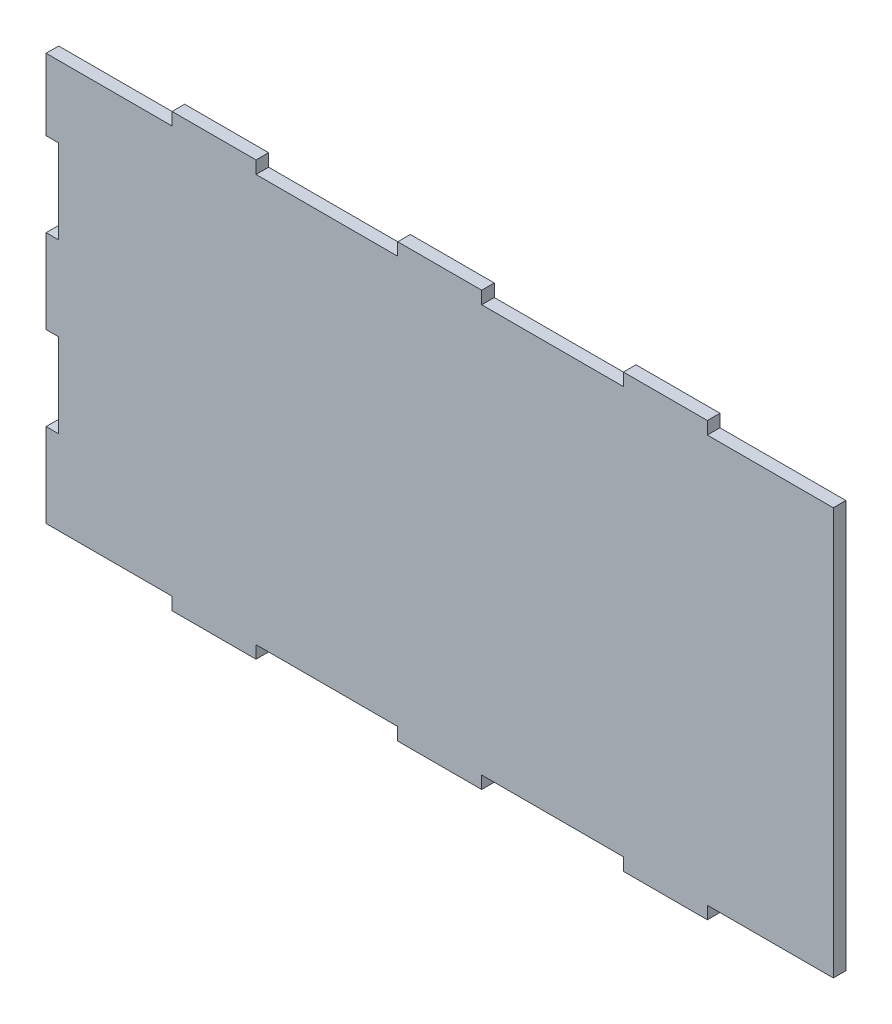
ISO-10303-21;
HEADER;
FILE_DESCRIPTION(('STEP AP214'),'2;1');
FILE_NAME('part.step','',(''),(''),'','','');
FILE_SCHEMA(('AUTOMOTIVE_DESIGN { 1 0 10303 214 1 1 1 1 }'));
ENDSEC;
DATA;
#1=APPLICATION_CONTEXT('core data for automotive mechanical design processes');
#2=APPLICATION_PROTOCOL_DEFINITION('international standard','automotive_design',2000,#1);
#3=PRODUCT_CONTEXT('',#1,'mechanical');
#4=PRODUCT('Part','Part','',(#3));
#5=PRODUCT_RELATED_PRODUCT_CATEGORY('part','',(#4));
#6=PRODUCT_DEFINITION_FORMATION('','',#4);
#7=PRODUCT_DEFINITION_CONTEXT('part definition',#1,'design');
#8=PRODUCT_DEFINITION('design','',#6,#7);
#9=PRODUCT_DEFINITION_SHAPE('','',#8);
#10=(LENGTH_UNIT() NAMED_UNIT(*) SI_UNIT(.MILLI.,.METRE.));
#11=(NAMED_UNIT(*) PLANE_ANGLE_UNIT() SI_UNIT($,.RADIAN.));
#12=(NAMED_UNIT(*) SI_UNIT($,.STERADIAN.) SOLID_ANGLE_UNIT());
#13=UNCERTAINTY_MEASURE_WITH_UNIT(LENGTH_MEASURE(1.E-05),#10,'distance_accuracy_value','');
#14=(GEOMETRIC_REPRESENTATION_CONTEXT(3) GLOBAL_UNCERTAINTY_ASSIGNED_CONTEXT((#13)) GLOBAL_UNIT_ASSIGNED_CONTEXT((#10,
#11,#12)) REPRESENTATION_CONTEXT('',''));
#15=CARTESIAN_POINT('',(0.,0.,0.));
#16=DIRECTION('',(0.,0.,1.));
#17=DIRECTION('',(1.,0.,0.));
#18=AXIS2_PLACEMENT_3D('',#15,#16,#17);
#19=CARTESIAN_POINT('',(-375.,-33.9999999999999,12.));
#20=DIRECTION('',(1.,0.,0.));
#21=DIRECTION('',(0.,0.,-1.));
#22=AXIS2_PLACEMENT_3D('',#19,#20,#21);
#23=PLANE('',#22);
#24=DIRECTION('',(0.,-1.,0.));
#25=VECTOR('',#24,1.);
#26=CARTESIAN_POINT('',(-375.,-33.9999999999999,0.));
#27=LINE('',#26,#25);
#28=CARTESIAN_POINT('',(-375.,46.0000000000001,0.));
#29=VERTEX_POINT('',#28);
#30=CARTESIAN_POINT('',(-375.,-33.9999999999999,0.));
#31=VERTEX_POINT('',#30);
#32=EDGE_CURVE('E17048',#29,#31,#27,.T.);
#33=ORIENTED_EDGE('',*,*,#32,.T.);
#34=DIRECTION('',(0.,0.,-1.));
#35=VECTOR('',#34,1.);
#36=CARTESIAN_POINT('',(-375.,-33.9999999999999,12.));
#37=LINE('',#36,#35);
#38=CARTESIAN_POINT('',(-375.,-33.9999999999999,12.));
#39=VERTEX_POINT('',#38);
#40=EDGE_CURVE('E12',#39,#31,#37,.T.);
#41=ORIENTED_EDGE('',*,*,#40,.F.);
#42=DIRECTION('',(0.,-1.,0.));
#43=VECTOR('',#42,1.);
#44=CARTESIAN_POINT('',(-375.,-33.9999999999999,12.));
#45=LINE('',#44,#43);
#46=CARTESIAN_POINT('',(-375.,46.0000000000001,12.));
#47=VERTEX_POINT('',#46);
#48=EDGE_CURVE('E17120',#47,#39,#45,.T.);
#49=ORIENTED_EDGE('',*,*,#48,.F.);
#50=DIRECTION('',(0.,0.,-1.));
#51=VECTOR('',#50,1.);
#52=CARTESIAN_POINT('',(-375.,46.0000000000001,12.));
#53=LINE('',#52,#51);
#54=EDGE_CURVE('E17044',#47,#29,#53,.T.);
#55=ORIENTED_EDGE('',*,*,#54,.T.);
#56=EDGE_LOOP('',(#33,#41,#49,#55));
#57=FACE_BOUND('',#56,.T.);
#58=ADVANCED_FACE('F16783',(#57),#23,.F.);
#59=CARTESIAN_POINT('',(-375.,-33.9999999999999,12.));
#60=DIRECTION('',(0.,1.,0.));
#61=DIRECTION('',(-1.,0.,0.));
#62=AXIS2_PLACEMENT_3D('',#59,#60,#61);
#63=PLANE('',#62);
#64=DIRECTION('',(1.,0.,0.));
#65=VECTOR('',#64,1.);
#66=CARTESIAN_POINT('',(-375.,-33.9999999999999,0.));
#67=LINE('',#66,#65);
#68=CARTESIAN_POINT('',(-363.,-33.9999999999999,0.));
#69=VERTEX_POINT('',#68);
#70=EDGE_CURVE('E17055',#31,#69,#67,.T.);
#71=ORIENTED_EDGE('',*,*,#70,.T.);
#72=DIRECTION('',(0.,0.,-1.));
#73=VECTOR('',#72,1.);
#74=CARTESIAN_POINT('',(-363.,-33.9999999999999,12.));
#75=LINE('',#74,#73);
#76=CARTESIAN_POINT('',(-363.,-33.9999999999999,12.));
#77=VERTEX_POINT('',#76);
#78=EDGE_CURVE('E16791',#77,#69,#75,.T.);
#79=ORIENTED_EDGE('',*,*,#78,.F.);
#80=DIRECTION('',(1.,0.,0.));
#81=VECTOR('',#80,1.);
#82=CARTESIAN_POINT('',(-375.,-33.9999999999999,12.));
#83=LINE('',#82,#81);
#84=EDGE_CURVE('E16928',#39,#77,#83,.T.);
#85=ORIENTED_EDGE('',*,*,#84,.F.);
#86=ORIENTED_EDGE('',*,*,#40,.T.);
#87=EDGE_LOOP('',(#71,#79,#85,#86));
#88=FACE_BOUND('',#87,.T.);
#89=ADVANCED_FACE('F17320',(#88),#63,.F.);
#90=CARTESIAN_POINT('',(-363.,-33.9999999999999,12.));
#91=DIRECTION('',(1.,0.,0.));
#92=DIRECTION('',(0.,0.,-1.));
#93=AXIS2_PLACEMENT_3D('',#90,#91,#92);
#94=PLANE('',#93);
#95=DIRECTION('',(0.,-1.,0.));
#96=VECTOR('',#95,1.);
#97=CARTESIAN_POINT('',(-363.,-33.9999999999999,0.));
#98=LINE('',#97,#96);
#99=CARTESIAN_POINT('',(-363.,-114.,0.));
#100=VERTEX_POINT('',#99);
#101=EDGE_CURVE('E17051',#69,#100,#98,.T.);
#102=ORIENTED_EDGE('',*,*,#101,.T.);
#103=DIRECTION('',(0.,0.,-1.));
#104=VECTOR('',#103,1.);
#105=CARTESIAN_POINT('',(-363.,-114.,12.));
#106=LINE('',#105,#104);
#107=CARTESIAN_POINT('',(-363.,-114.,12.));
#108=VERTEX_POINT('',#107);
#109=EDGE_CURVE('E17209',#108,#100,#106,.T.);
#110=ORIENTED_EDGE('',*,*,#109,.F.);
#111=DIRECTION('',(0.,-1.,0.));
#112=VECTOR('',#111,1.);
#113=CARTESIAN_POINT('',(-363.,-33.9999999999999,12.));
#114=LINE('',#113,#112);
#115=EDGE_CURVE('E17219',#77,#108,#114,.T.);
#116=ORIENTED_EDGE('',*,*,#115,.F.);
#117=ORIENTED_EDGE('',*,*,#78,.T.);
#118=EDGE_LOOP('',(#102,#110,#116,#117));
#119=FACE_BOUND('',#118,.T.);
#120=ADVANCED_FACE('F17217',(#119),#94,.F.);
#121=CARTESIAN_POINT('',(-375.,-114.,12.));
#122=DIRECTION('',(0.,-1.,0.));
#123=DIRECTION('',(0.,0.,-1.));
#124=AXIS2_PLACEMENT_3D('',#121,#122,#123);
#125=PLANE('',#124);
#126=DIRECTION('',(-1.,0.,0.));
#127=VECTOR('',#126,1.);
#128=CARTESIAN_POINT('',(-375.,-114.,0.));
#129=LINE('',#128,#127);
#130=CARTESIAN_POINT('',(-375.,-114.,0.));
#131=VERTEX_POINT('',#130);
#132=EDGE_CURVE('E17057',#100,#131,#129,.T.);
#133=ORIENTED_EDGE('',*,*,#132,.T.);
#134=DIRECTION('',(0.,0.,-1.));
#135=VECTOR('',#134,1.);
#136=CARTESIAN_POINT('',(-375.,-114.,12.));
#137=LINE('',#136,#135);
#138=CARTESIAN_POINT('',(-375.,-114.,12.));
#139=VERTEX_POINT('',#138);
#140=EDGE_CURVE('E17210',#139,#131,#137,.T.);
#141=ORIENTED_EDGE('',*,*,#140,.F.);
#142=DIRECTION('',(-1.,0.,0.));
#143=VECTOR('',#142,1.);
#144=CARTESIAN_POINT('',(-375.,-114.,12.));
#145=LINE('',#144,#143);
#146=EDGE_CURVE('E17237',#108,#139,#145,.T.);
#147=ORIENTED_EDGE('',*,*,#146,.F.);
#148=ORIENTED_EDGE('',*,*,#109,.T.);
#149=EDGE_LOOP('',(#133,#141,#147,#148));
#150=FACE_BOUND('',#149,.T.);
#151=ADVANCED_FACE('F17229',(#150),#125,.F.);
#152=CARTESIAN_POINT('',(-375.,-194.,12.));
#153=DIRECTION('',(1.,0.,0.));
#154=DIRECTION('',(0.,0.,-1.));
#155=AXIS2_PLACEMENT_3D('',#152,#153,#154);
#156=PLANE('',#155);
#157=DIRECTION('',(0.,-1.,0.));
#158=VECTOR('',#157,1.);
#159=CARTESIAN_POINT('',(-375.,-194.,0.));
#160=LINE('',#159,#158);
#161=CARTESIAN_POINT('',(-375.,-194.,0.));
#162=VERTEX_POINT('',#161);
#163=EDGE_CURVE('E17059',#131,#162,#160,.T.);
#164=ORIENTED_EDGE('',*,*,#163,.T.);
#165=DIRECTION('',(0.,0.,-1.));
#166=VECTOR('',#165,1.);
#167=CARTESIAN_POINT('',(-375.,-194.,12.));
#168=LINE('',#167,#166);
#169=CARTESIAN_POINT('',(-375.,-194.,12.));
#170=VERTEX_POINT('',#169);
#171=EDGE_CURVE('E17202',#170,#162,#168,.T.);
#172=ORIENTED_EDGE('',*,*,#171,.F.);
#173=DIRECTION('',(0.,-1.,0.));
#174=VECTOR('',#173,1.);
#175=CARTESIAN_POINT('',(-375.,-194.,12.));
#176=LINE('',#175,#174);
#177=EDGE_CURVE('E17231',#139,#170,#176,.T.);
#178=ORIENTED_EDGE('',*,*,#177,.F.);
#179=ORIENTED_EDGE('',*,*,#140,.T.);
#180=EDGE_LOOP('',(#164,#172,#178,#179));
#181=FACE_BOUND('',#180,.T.);
#182=ADVANCED_FACE('F17232',(#181),#156,.F.);
#183=CARTESIAN_POINT('',(-375.,-194.,12.));
#184=DIRECTION('',(0.,1.,0.));
#185=DIRECTION('',(0.,0.,1.));
#186=AXIS2_PLACEMENT_3D('',#183,#184,#185);
#187=PLANE('',#186);
#188=DIRECTION('',(1.,0.,0.));
#189=VECTOR('',#188,1.);
#190=CARTESIAN_POINT('',(-375.,-194.,0.));
#191=LINE('',#190,#189);
#192=CARTESIAN_POINT('',(-255.,-194.,0.));
#193=VERTEX_POINT('',#192);
#194=EDGE_CURVE('E17058',#162,#193,#191,.T.);
#195=ORIENTED_EDGE('',*,*,#194,.T.);
#196=DIRECTION('',(0.,0.,-1.));
#197=VECTOR('',#196,1.);
#198=CARTESIAN_POINT('',(-255.,-194.,12.));
#199=LINE('',#198,#197);
#200=CARTESIAN_POINT('',(-255.,-194.,12.));
#201=VERTEX_POINT('',#200);
#202=EDGE_CURVE('E17201',#201,#193,#199,.T.);
#203=ORIENTED_EDGE('',*,*,#202,.F.);
#204=DIRECTION('',(1.,0.,0.));
#205=VECTOR('',#204,1.);
#206=CARTESIAN_POINT('',(-375.,-194.,12.));
#207=LINE('',#206,#205);
#208=EDGE_CURVE('E17233',#170,#201,#207,.T.);
#209=ORIENTED_EDGE('',*,*,#208,.F.);
#210=ORIENTED_EDGE('',*,*,#171,.T.);
#211=EDGE_LOOP('',(#195,#203,#209,#210));
#212=FACE_BOUND('',#211,.T.);
#213=ADVANCED_FACE('F17328',(#212),#187,.F.);
#214=CARTESIAN_POINT('',(-255.,-194.,12.));
#215=DIRECTION('',(1.,0.,0.));
#216=DIRECTION('',(0.,0.,-1.));
#217=AXIS2_PLACEMENT_3D('',#214,#215,#216);
#218=PLANE('',#217);
#219=DIRECTION('',(0.,-1.,0.));
#220=VECTOR('',#219,1.);
#221=CARTESIAN_POINT('',(-255.,-194.,0.));
#222=LINE('',#221,#220);
#223=CARTESIAN_POINT('',(-255.,-206.,0.));
#224=VERTEX_POINT('',#223);
#225=EDGE_CURVE('E17064',#193,#224,#222,.T.);
#226=ORIENTED_EDGE('',*,*,#225,.T.);
#227=DIRECTION('',(0.,0.,-1.));
#228=VECTOR('',#227,1.);
#229=CARTESIAN_POINT('',(-255.,-206.,12.));
#230=LINE('',#229,#228);
#231=CARTESIAN_POINT('',(-255.,-206.,12.));
#232=VERTEX_POINT('',#231);
#233=EDGE_CURVE('E17196',#232,#224,#230,.T.);
#234=ORIENTED_EDGE('',*,*,#233,.F.);
#235=DIRECTION('',(0.,-1.,0.));
#236=VECTOR('',#235,1.);
#237=CARTESIAN_POINT('',(-255.,-194.,12.));
#238=LINE('',#237,#236);
#239=EDGE_CURVE('E17239',#201,#232,#238,.T.);
#240=ORIENTED_EDGE('',*,*,#239,.F.);
#241=ORIENTED_EDGE('',*,*,#202,.T.);
#242=EDGE_LOOP('',(#226,#234,#240,#241));
#243=FACE_BOUND('',#242,.T.);
#244=ADVANCED_FACE('F17334',(#243),#218,.F.);
#245=CARTESIAN_POINT('',(-175.,-206.,12.));
#246=DIRECTION('',(0.,1.,0.));
#247=DIRECTION('',(0.,0.,1.));
#248=AXIS2_PLACEMENT_3D('',#245,#246,#247);
#249=PLANE('',#248);
#250=DIRECTION('',(1.,0.,0.));
#251=VECTOR('',#250,1.);
#252=CARTESIAN_POINT('',(-175.,-206.,0.));
#253=LINE('',#252,#251);
#254=CARTESIAN_POINT('',(-175.,-206.,0.));
#255=VERTEX_POINT('',#254);
#256=EDGE_CURVE('E17065',#224,#255,#253,.T.);
#257=ORIENTED_EDGE('',*,*,#256,.T.);
#258=DIRECTION('',(0.,0.,-1.));
#259=VECTOR('',#258,1.);
#260=CARTESIAN_POINT('',(-175.,-206.,12.));
#261=LINE('',#260,#259);
#262=CARTESIAN_POINT('',(-175.,-206.,12.));
#263=VERTEX_POINT('',#262);
#264=EDGE_CURVE('E17194',#263,#255,#261,.T.);
#265=ORIENTED_EDGE('',*,*,#264,.F.);
#266=DIRECTION('',(1.,0.,0.));
#267=VECTOR('',#266,1.);
#268=CARTESIAN_POINT('',(-175.,-206.,12.));
#269=LINE('',#268,#267);
#270=EDGE_CURVE('E17245',#232,#263,#269,.T.);
#271=ORIENTED_EDGE('',*,*,#270,.F.);
#272=ORIENTED_EDGE('',*,*,#233,.T.);
#273=EDGE_LOOP('',(#257,#265,#271,#272));
#274=FACE_BOUND('',#273,.T.);
#275=ADVANCED_FACE('F17339',(#274),#249,.F.);
#276=CARTESIAN_POINT('',(-175.,-206.,12.));
#277=DIRECTION('',(-1.,0.,0.));
#278=DIRECTION('',(0.,0.,1.));
#279=AXIS2_PLACEMENT_3D('',#276,#277,#278);
#280=PLANE('',#279);
#281=DIRECTION('',(0.,1.,0.));
#282=VECTOR('',#281,1.);
#283=CARTESIAN_POINT('',(-175.,-206.,0.));
#284=LINE('',#283,#282);
#285=CARTESIAN_POINT('',(-175.,-194.,0.));
#286=VERTEX_POINT('',#285);
#287=EDGE_CURVE('E17067',#255,#286,#284,.T.);
#288=ORIENTED_EDGE('',*,*,#287,.T.);
#289=DIRECTION('',(0.,0.,-1.));
#290=VECTOR('',#289,1.);
#291=CARTESIAN_POINT('',(-175.,-194.,12.));
#292=LINE('',#291,#290);
#293=CARTESIAN_POINT('',(-175.,-194.,12.));
#294=VERTEX_POINT('',#293);
#295=EDGE_CURVE('E17192',#294,#286,#292,.T.);
#296=ORIENTED_EDGE('',*,*,#295,.F.);
#297=DIRECTION('',(0.,1.,0.));
#298=VECTOR('',#297,1.);
#299=CARTESIAN_POINT('',(-175.,-206.,12.));
#300=LINE('',#299,#298);
#301=EDGE_CURVE('E17248',#263,#294,#300,.T.);
#302=ORIENTED_EDGE('',*,*,#301,.F.);
#303=ORIENTED_EDGE('',*,*,#264,.T.);
#304=EDGE_LOOP('',(#288,#296,#302,#303));
#305=FACE_BOUND('',#304,.T.);
#306=ADVANCED_FACE('F17342',(#305),#280,.F.);
#307=CARTESIAN_POINT('',(-175.,-194.,12.));
#308=DIRECTION('',(0.,1.,0.));
#309=DIRECTION('',(0.,0.,1.));
#310=AXIS2_PLACEMENT_3D('',#307,#308,#309);
#311=PLANE('',#310);
#312=DIRECTION('',(1.,0.,0.));
#313=VECTOR('',#312,1.);
#314=CARTESIAN_POINT('',(-175.,-194.,0.));
#315=LINE('',#314,#313);
#316=CARTESIAN_POINT('',(-40.,-194.,0.));
#317=VERTEX_POINT('',#316);
#318=EDGE_CURVE('E17066',#286,#317,#315,.T.);
#319=ORIENTED_EDGE('',*,*,#318,.T.);
#320=DIRECTION('',(0.,0.,-1.));
#321=VECTOR('',#320,1.);
#322=CARTESIAN_POINT('',(-40.,-194.,12.));
#323=LINE('',#322,#321);
#324=CARTESIAN_POINT('',(-40.,-194.,12.));
#325=VERTEX_POINT('',#324);
#326=EDGE_CURVE('E17190',#325,#317,#323,.T.);
#327=ORIENTED_EDGE('',*,*,#326,.F.);
#328=DIRECTION('',(1.,0.,0.));
#329=VECTOR('',#328,1.);
#330=CARTESIAN_POINT('',(-175.,-194.,12.));
#331=LINE('',#330,#329);
#332=EDGE_CURVE('E17246',#294,#325,#331,.T.);
#333=ORIENTED_EDGE('',*,*,#332,.F.);
#334=ORIENTED_EDGE('',*,*,#295,.T.);
#335=EDGE_LOOP('',(#319,#327,#333,#334));
#336=FACE_BOUND('',#335,.T.);
#337=ADVANCED_FACE('F17343',(#336),#311,.F.);
#338=CARTESIAN_POINT('',(-40.,-206.,12.));
#339=DIRECTION('',(1.,0.,0.));
#340=DIRECTION('',(0.,0.,-1.));
#341=AXIS2_PLACEMENT_3D('',#338,#339,#340);
#342=PLANE('',#341);
#343=DIRECTION('',(0.,-1.,0.));
#344=VECTOR('',#343,1.);
#345=CARTESIAN_POINT('',(-40.,-206.,0.));
#346=LINE('',#345,#344);
#347=CARTESIAN_POINT('',(-40.,-206.,0.));
#348=VERTEX_POINT('',#347);
#349=EDGE_CURVE('E17068',#317,#348,#346,.T.);
#350=ORIENTED_EDGE('',*,*,#349,.T.);
#351=DIRECTION('',(0.,0.,-1.));
#352=VECTOR('',#351,1.);
#353=CARTESIAN_POINT('',(-40.,-206.,12.));
#354=LINE('',#353,#352);
#355=CARTESIAN_POINT('',(-40.,-206.,12.));
#356=VERTEX_POINT('',#355);
#357=EDGE_CURVE('E17188',#356,#348,#354,.T.);
#358=ORIENTED_EDGE('',*,*,#357,.F.);
#359=DIRECTION('',(0.,-1.,0.));
#360=VECTOR('',#359,1.);
#361=CARTESIAN_POINT('',(-40.,-206.,12.));
#362=LINE('',#361,#360);
#363=EDGE_CURVE('E17249',#325,#356,#362,.T.);
#364=ORIENTED_EDGE('',*,*,#363,.F.);
#365=ORIENTED_EDGE('',*,*,#326,.T.);
#366=EDGE_LOOP('',(#350,#358,#364,#365));
#367=FACE_BOUND('',#366,.T.);
#368=ADVANCED_FACE('F17346',(#367),#342,.F.);
#369=CARTESIAN_POINT('',(40.,-206.,12.));
#370=DIRECTION('',(0.,1.,0.));
#371=DIRECTION('',(0.,0.,1.));
#372=AXIS2_PLACEMENT_3D('',#369,#370,#371);
#373=PLANE('',#372);
#374=DIRECTION('',(1.,0.,0.));
#375=VECTOR('',#374,1.);
#376=CARTESIAN_POINT('',(40.,-206.,0.));
#377=LINE('',#376,#375);
#378=CARTESIAN_POINT('',(40.,-206.,0.));
#379=VERTEX_POINT('',#378);
#380=EDGE_CURVE('E17075',#348,#379,#377,.T.);
#381=ORIENTED_EDGE('',*,*,#380,.T.);
#382=DIRECTION('',(0.,0.,-1.));
#383=VECTOR('',#382,1.);
#384=CARTESIAN_POINT('',(40.,-206.,12.));
#385=LINE('',#384,#383);
#386=CARTESIAN_POINT('',(40.,-206.,12.));
#387=VERTEX_POINT('',#386);
#388=EDGE_CURVE('E17184',#387,#379,#385,.T.);
#389=ORIENTED_EDGE('',*,*,#388,.F.);
#390=DIRECTION('',(1.,0.,0.));
#391=VECTOR('',#390,1.);
#392=CARTESIAN_POINT('',(40.,-206.,12.));
#393=LINE('',#392,#391);
#394=EDGE_CURVE('E17255',#356,#387,#393,.T.);
#395=ORIENTED_EDGE('',*,*,#394,.F.);
#396=ORIENTED_EDGE('',*,*,#357,.T.);
#397=EDGE_LOOP('',(#381,#389,#395,#396));
#398=FACE_BOUND('',#397,.T.);
#399=ADVANCED_FACE('F17352',(#398),#373,.F.);
#400=CARTESIAN_POINT('',(40.,-206.,12.));
#401=DIRECTION('',(-1.,0.,0.));
#402=DIRECTION('',(0.,0.,1.));
#403=AXIS2_PLACEMENT_3D('',#400,#401,#402);
#404=PLANE('',#403);
#405=DIRECTION('',(0.,1.,0.));
#406=VECTOR('',#405,1.);
#407=CARTESIAN_POINT('',(40.,-206.,0.));
#408=LINE('',#407,#406);
#409=CARTESIAN_POINT('',(40.,-194.,0.));
#410=VERTEX_POINT('',#409);
#411=EDGE_CURVE('E17071',#379,#410,#408,.T.);
#412=ORIENTED_EDGE('',*,*,#411,.T.);
#413=DIRECTION('',(0.,0.,-1.));
#414=VECTOR('',#413,1.);
#415=CARTESIAN_POINT('',(40.,-194.,12.));
#416=LINE('',#415,#414);
#417=CARTESIAN_POINT('',(40.,-194.,12.));
#418=VERTEX_POINT('',#417);
#419=EDGE_CURVE('E17178',#418,#410,#416,.T.);
#420=ORIENTED_EDGE('',*,*,#419,.F.);
#421=DIRECTION('',(0.,1.,0.));
#422=VECTOR('',#421,1.);
#423=CARTESIAN_POINT('',(40.,-206.,12.));
#424=LINE('',#423,#422);
#425=EDGE_CURVE('E17254',#387,#418,#424,.T.);
#426=ORIENTED_EDGE('',*,*,#425,.F.);
#427=ORIENTED_EDGE('',*,*,#388,.T.);
#428=EDGE_LOOP('',(#412,#420,#426,#427));
#429=FACE_BOUND('',#428,.T.);
#430=ADVANCED_FACE('F17357',(#429),#404,.F.);
#431=CARTESIAN_POINT('',(40.,-194.,12.));
#432=DIRECTION('',(0.,1.,0.));
#433=DIRECTION('',(-1.,0.,0.));
#434=AXIS2_PLACEMENT_3D('',#431,#432,#433);
#435=PLANE('',#434);
#436=DIRECTION('',(1.,0.,0.));
#437=VECTOR('',#436,1.);
#438=CARTESIAN_POINT('',(40.,-194.,0.));
#439=LINE('',#438,#437);
#440=CARTESIAN_POINT('',(175.,-194.,0.));
#441=VERTEX_POINT('',#440);
#442=EDGE_CURVE('E17078',#410,#441,#439,.T.);
#443=ORIENTED_EDGE('',*,*,#442,.T.);
#444=DIRECTION('',(0.,0.,-1.));
#445=VECTOR('',#444,1.);
#446=CARTESIAN_POINT('',(175.,-194.,12.));
#447=LINE('',#446,#445);
#448=CARTESIAN_POINT('',(175.,-194.,12.));
#449=VERTEX_POINT('',#448);
#450=EDGE_CURVE('E17180',#449,#441,#447,.T.);
#451=ORIENTED_EDGE('',*,*,#450,.F.);
#452=DIRECTION('',(1.,0.,0.));
#453=VECTOR('',#452,1.);
#454=CARTESIAN_POINT('',(40.,-194.,12.));
#455=LINE('',#454,#453);
#456=EDGE_CURVE('E17256',#418,#449,#455,.T.);
#457=ORIENTED_EDGE('',*,*,#456,.F.);
#458=ORIENTED_EDGE('',*,*,#419,.T.);
#459=EDGE_LOOP('',(#443,#451,#457,#458));
#460=FACE_BOUND('',#459,.T.);
#461=ADVANCED_FACE('F17363',(#460),#435,.F.);
#462=CARTESIAN_POINT('',(175.,-206.,12.));
#463=DIRECTION('',(1.,0.,0.));
#464=DIRECTION('',(0.,0.,-1.));
#465=AXIS2_PLACEMENT_3D('',#462,#463,#464);
#466=PLANE('',#465);
#467=DIRECTION('',(0.,-1.,0.));
#468=VECTOR('',#467,1.);
#469=CARTESIAN_POINT('',(175.,-206.,0.));
#470=LINE('',#469,#468);
#471=CARTESIAN_POINT('',(175.,-206.,0.));
#472=VERTEX_POINT('',#471);
#473=EDGE_CURVE('E17077',#441,#472,#470,.T.);
#474=ORIENTED_EDGE('',*,*,#473,.T.);
#475=DIRECTION('',(0.,0.,-1.));
#476=VECTOR('',#475,1.);
#477=CARTESIAN_POINT('',(175.,-206.,12.));
#478=LINE('',#477,#476);
#479=CARTESIAN_POINT('',(175.,-206.,12.));
#480=VERTEX_POINT('',#479);
#481=EDGE_CURVE('E17175',#480,#472,#478,.T.);
#482=ORIENTED_EDGE('',*,*,#481,.F.);
#483=DIRECTION('',(0.,-1.,0.));
#484=VECTOR('',#483,1.);
#485=CARTESIAN_POINT('',(175.,-206.,12.));
#486=LINE('',#485,#484);
#487=EDGE_CURVE('E17258',#449,#480,#486,.T.);
#488=ORIENTED_EDGE('',*,*,#487,.F.);
#489=ORIENTED_EDGE('',*,*,#450,.T.);
#490=EDGE_LOOP('',(#474,#482,#488,#489));
#491=FACE_BOUND('',#490,.T.);
#492=ADVANCED_FACE('F17362',(#491),#466,.F.);
#493=CARTESIAN_POINT('',(255.,-206.,12.));
#494=DIRECTION('',(0.,1.,0.));
#495=DIRECTION('',(0.,0.,1.));
#496=AXIS2_PLACEMENT_3D('',#493,#494,#495);
#497=PLANE('',#496);
#498=DIRECTION('',(1.,0.,0.));
#499=VECTOR('',#498,1.);
#500=CARTESIAN_POINT('',(255.,-206.,0.));
#501=LINE('',#500,#499);
#502=CARTESIAN_POINT('',(255.,-206.,0.));
#503=VERTEX_POINT('',#502);
#504=EDGE_CURVE('E17076',#472,#503,#501,.T.);
#505=ORIENTED_EDGE('',*,*,#504,.T.);
#506=DIRECTION('',(0.,0.,-1.));
#507=VECTOR('',#506,1.);
#508=CARTESIAN_POINT('',(255.,-206.,12.));
#509=LINE('',#508,#507);
#510=CARTESIAN_POINT('',(255.,-206.,12.));
#511=VERTEX_POINT('',#510);
#512=EDGE_CURVE('E17173',#511,#503,#509,.T.);
#513=ORIENTED_EDGE('',*,*,#512,.F.);
#514=DIRECTION('',(1.,0.,0.));
#515=VECTOR('',#514,1.);
#516=CARTESIAN_POINT('',(255.,-206.,12.));
#517=LINE('',#516,#515);
#518=EDGE_CURVE('E17259',#480,#511,#517,.T.);
#519=ORIENTED_EDGE('',*,*,#518,.F.);
#520=ORIENTED_EDGE('',*,*,#481,.T.);
#521=EDGE_LOOP('',(#505,#513,#519,#520));
#522=FACE_BOUND('',#521,.T.);
#523=ADVANCED_FACE('F17367',(#522),#497,.F.);
#524=CARTESIAN_POINT('',(255.,-206.,12.));
#525=DIRECTION('',(-1.,0.,0.));
#526=DIRECTION('',(0.,0.,1.));
#527=AXIS2_PLACEMENT_3D('',#524,#525,#526);
#528=PLANE('',#527);
#529=DIRECTION('',(0.,1.,0.));
#530=VECTOR('',#529,1.);
#531=CARTESIAN_POINT('',(255.,-206.,0.));
#532=LINE('',#531,#530);
#533=CARTESIAN_POINT('',(255.,-194.,0.));
#534=VERTEX_POINT('',#533);
#535=EDGE_CURVE('E17082',#503,#534,#532,.T.);
#536=ORIENTED_EDGE('',*,*,#535,.T.);
#537=DIRECTION('',(0.,0.,-1.));
#538=VECTOR('',#537,1.);
#539=CARTESIAN_POINT('',(255.,-194.,12.));
#540=LINE('',#539,#538);
#541=CARTESIAN_POINT('',(255.,-194.,12.));
#542=VERTEX_POINT('',#541);
#543=EDGE_CURVE('E17169',#542,#534,#540,.T.);
#544=ORIENTED_EDGE('',*,*,#543,.F.);
#545=DIRECTION('',(0.,1.,0.));
#546=VECTOR('',#545,1.);
#547=CARTESIAN_POINT('',(255.,-206.,12.));
#548=LINE('',#547,#546);
#549=EDGE_CURVE('E17265',#511,#542,#548,.T.);
#550=ORIENTED_EDGE('',*,*,#549,.F.);
#551=ORIENTED_EDGE('',*,*,#512,.T.);
#552=EDGE_LOOP('',(#536,#544,#550,#551));
#553=FACE_BOUND('',#552,.T.);
#554=ADVANCED_FACE('F17373',(#553),#528,.F.);
#555=CARTESIAN_POINT('',(255.,-194.,12.));
#556=DIRECTION('',(0.,1.,0.));
#557=DIRECTION('',(0.,0.,1.));
#558=AXIS2_PLACEMENT_3D('',#555,#556,#557);
#559=PLANE('',#558);
#560=DIRECTION('',(1.,0.,0.));
#561=VECTOR('',#560,1.);
#562=CARTESIAN_POINT('',(255.,-194.,0.));
#563=LINE('',#562,#561);
#564=CARTESIAN_POINT('',(375.,-194.,0.));
#565=VERTEX_POINT('',#564);
#566=EDGE_CURVE('E17085',#534,#565,#563,.T.);
#567=ORIENTED_EDGE('',*,*,#566,.T.);
#568=DIRECTION('',(0.,0.,-1.));
#569=VECTOR('',#568,1.);
#570=CARTESIAN_POINT('',(375.,-194.,12.));
#571=LINE('',#570,#569);
#572=CARTESIAN_POINT('',(375.,-194.,12.));
#573=VERTEX_POINT('',#572);
#574=EDGE_CURVE('E17163',#573,#565,#571,.T.);
#575=ORIENTED_EDGE('',*,*,#574,.F.);
#576=DIRECTION('',(1.,0.,0.));
#577=VECTOR('',#576,1.);
#578=CARTESIAN_POINT('',(255.,-194.,12.));
#579=LINE('',#578,#577);
#580=EDGE_CURVE('E17262',#542,#573,#579,.T.);
#581=ORIENTED_EDGE('',*,*,#580,.F.);
#582=ORIENTED_EDGE('',*,*,#543,.T.);
#583=EDGE_LOOP('',(#567,#575,#581,#582));
#584=FACE_BOUND('',#583,.T.);
#585=ADVANCED_FACE('F17380',(#584),#559,.F.);
#586=CARTESIAN_POINT('',(375.,-194.,12.));
#587=DIRECTION('',(-1.,0.,0.));
#588=DIRECTION('',(0.,-1.,0.));
#589=AXIS2_PLACEMENT_3D('',#586,#587,#588);
#590=PLANE('',#589);
#591=DIRECTION('',(0.,1.,0.));
#592=VECTOR('',#591,1.);
#593=CARTESIAN_POINT('',(375.,-194.,0.));
#594=LINE('',#593,#592);
#595=CARTESIAN_POINT('',(375.,194.,0.));
#596=VERTEX_POINT('',#595);
#597=EDGE_CURVE('E17088',#565,#596,#594,.T.);
#598=ORIENTED_EDGE('',*,*,#597,.T.);
#599=DIRECTION('',(0.,0.,-1.));
#600=VECTOR('',#599,1.);
#601=CARTESIAN_POINT('',(375.,194.,12.));
#602=LINE('',#601,#600);
#603=CARTESIAN_POINT('',(375.,194.,12.));
#604=VERTEX_POINT('',#603);
#605=EDGE_CURVE('E17165',#604,#596,#602,.T.);
#606=ORIENTED_EDGE('',*,*,#605,.F.);
#607=DIRECTION('',(0.,1.,0.));
#608=VECTOR('',#607,1.);
#609=CARTESIAN_POINT('',(375.,-194.,12.));
#610=LINE('',#609,#608);
#611=EDGE_CURVE('E17266',#573,#604,#610,.T.);
#612=ORIENTED_EDGE('',*,*,#611,.F.);
#613=ORIENTED_EDGE('',*,*,#574,.T.);
#614=EDGE_LOOP('',(#598,#606,#612,#613));
#615=FACE_BOUND('',#614,.T.);
#616=ADVANCED_FACE('F17382',(#615),#590,.F.);
#617=CARTESIAN_POINT('',(255.,194.,12.));
#618=DIRECTION('',(0.,-1.,0.));
#619=DIRECTION('',(0.,0.,-1.));
#620=AXIS2_PLACEMENT_3D('',#617,#618,#619);
#621=PLANE('',#620);
#622=DIRECTION('',(-1.,0.,0.));
#623=VECTOR('',#622,1.);
#624=CARTESIAN_POINT('',(255.,194.,0.));
#625=LINE('',#624,#623);
#626=CARTESIAN_POINT('',(255.,194.,0.));
#627=VERTEX_POINT('',#626);
#628=EDGE_CURVE('E17086',#596,#627,#625,.T.);
#629=ORIENTED_EDGE('',*,*,#628,.T.);
#630=DIRECTION('',(0.,0.,-1.));
#631=VECTOR('',#630,1.);
#632=CARTESIAN_POINT('',(255.,194.,12.));
#633=LINE('',#632,#631);
#634=CARTESIAN_POINT('',(255.,194.,12.));
#635=VERTEX_POINT('',#634);
#636=EDGE_CURVE('E17158',#635,#627,#633,.T.);
#637=ORIENTED_EDGE('',*,*,#636,.F.);
#638=DIRECTION('',(-1.,0.,0.));
#639=VECTOR('',#638,1.);
#640=CARTESIAN_POINT('',(255.,194.,12.));
#641=LINE('',#640,#639);
#642=EDGE_CURVE('E17267',#604,#635,#641,.T.);
#643=ORIENTED_EDGE('',*,*,#642,.F.);
#644=ORIENTED_EDGE('',*,*,#605,.T.);
#645=EDGE_LOOP('',(#629,#637,#643,#644));
#646=FACE_BOUND('',#645,.T.);
#647=ADVANCED_FACE('F17383',(#646),#621,.F.);
#648=CARTESIAN_POINT('',(255.,206.,12.));
#649=DIRECTION('',(-1.,0.,0.));
#650=DIRECTION('',(0.,0.,1.));
#651=AXIS2_PLACEMENT_3D('',#648,#649,#650);
#652=PLANE('',#651);
#653=DIRECTION('',(0.,1.,0.));
#654=VECTOR('',#653,1.);
#655=CARTESIAN_POINT('',(255.,206.,0.));
#656=LINE('',#655,#654);
#657=CARTESIAN_POINT('',(255.,206.,0.));
#658=VERTEX_POINT('',#657);
#659=EDGE_CURVE('E17087',#627,#658,#656,.T.);
#660=ORIENTED_EDGE('',*,*,#659,.T.);
#661=DIRECTION('',(0.,0.,-1.));
#662=VECTOR('',#661,1.);
#663=CARTESIAN_POINT('',(255.,206.,12.));
#664=LINE('',#663,#662);
#665=CARTESIAN_POINT('',(255.,206.,12.));
#666=VERTEX_POINT('',#665);
#667=EDGE_CURVE('E17156',#666,#658,#664,.T.);
#668=ORIENTED_EDGE('',*,*,#667,.F.);
#669=DIRECTION('',(0.,1.,0.));
#670=VECTOR('',#669,1.);
#671=CARTESIAN_POINT('',(255.,206.,12.));
#672=LINE('',#671,#670);
#673=EDGE_CURVE('E17269',#635,#666,#672,.T.);
#674=ORIENTED_EDGE('',*,*,#673,.F.);
#675=ORIENTED_EDGE('',*,*,#636,.T.);
#676=EDGE_LOOP('',(#660,#668,#674,#675));
#677=FACE_BOUND('',#676,.T.);
#678=ADVANCED_FACE('F17386',(#677),#652,.F.);
#679=CARTESIAN_POINT('',(255.,206.,12.));
#680=DIRECTION('',(0.,-1.,0.));
#681=DIRECTION('',(1.,0.,0.));
#682=AXIS2_PLACEMENT_3D('',#679,#680,#681);
#683=PLANE('',#682);
#684=DIRECTION('',(-1.,0.,0.));
#685=VECTOR('',#684,1.);
#686=CARTESIAN_POINT('',(255.,206.,0.));
#687=LINE('',#686,#685);
#688=CARTESIAN_POINT('',(175.,206.,0.));
#689=VERTEX_POINT('',#688);
#690=EDGE_CURVE('E17095',#658,#689,#687,.T.);
#691=ORIENTED_EDGE('',*,*,#690,.T.);
#692=DIRECTION('',(0.,0.,-1.));
#693=VECTOR('',#692,1.);
#694=CARTESIAN_POINT('',(175.,206.,12.));
#695=LINE('',#694,#693);
#696=CARTESIAN_POINT('',(175.,206.,12.));
#697=VERTEX_POINT('',#696);
#698=EDGE_CURVE('E17153',#697,#689,#695,.T.);
#699=ORIENTED_EDGE('',*,*,#698,.F.);
#700=DIRECTION('',(-1.,0.,0.));
#701=VECTOR('',#700,1.);
#702=CARTESIAN_POINT('',(255.,206.,12.));
#703=LINE('',#702,#701);
#704=EDGE_CURVE('E17275',#666,#697,#703,.T.);
#705=ORIENTED_EDGE('',*,*,#704,.F.);
#706=ORIENTED_EDGE('',*,*,#667,.T.);
#707=EDGE_LOOP('',(#691,#699,#705,#706));
#708=FACE_BOUND('',#707,.T.);
#709=ADVANCED_FACE('F17392',(#708),#683,.F.);
#710=CARTESIAN_POINT('',(175.,206.,12.));
#711=DIRECTION('',(1.,0.,0.));
#712=DIRECTION('',(0.,0.,-1.));
#713=AXIS2_PLACEMENT_3D('',#710,#711,#712);
#714=PLANE('',#713);
#715=DIRECTION('',(0.,-1.,0.));
#716=VECTOR('',#715,1.);
#717=CARTESIAN_POINT('',(175.,206.,0.));
#718=LINE('',#717,#716);
#719=CARTESIAN_POINT('',(175.,194.,0.));
#720=VERTEX_POINT('',#719);
#721=EDGE_CURVE('E17092',#689,#720,#718,.T.);
#722=ORIENTED_EDGE('',*,*,#721,.T.);
#723=DIRECTION('',(0.,0.,-1.));
#724=VECTOR('',#723,1.);
#725=CARTESIAN_POINT('',(175.,194.,12.));
#726=LINE('',#725,#724);
#727=CARTESIAN_POINT('',(175.,194.,12.));
#728=VERTEX_POINT('',#727);
#729=EDGE_CURVE('E17149',#728,#720,#726,.T.);
#730=ORIENTED_EDGE('',*,*,#729,.F.);
#731=DIRECTION('',(0.,-1.,0.));
#732=VECTOR('',#731,1.);
#733=CARTESIAN_POINT('',(175.,206.,12.));
#734=LINE('',#733,#732);
#735=EDGE_CURVE('E17271',#697,#728,#734,.T.);
#736=ORIENTED_EDGE('',*,*,#735,.F.);
#737=ORIENTED_EDGE('',*,*,#698,.T.);
#738=EDGE_LOOP('',(#722,#730,#736,#737));
#739=FACE_BOUND('',#738,.T.);
#740=ADVANCED_FACE('F17400',(#739),#714,.F.);
#741=CARTESIAN_POINT('',(40.,194.,12.));
#742=DIRECTION('',(0.,-1.,0.));
#743=DIRECTION('',(1.,0.,0.));
#744=AXIS2_PLACEMENT_3D('',#741,#742,#743);
#745=PLANE('',#744);
#746=DIRECTION('',(-1.,0.,0.));
#747=VECTOR('',#746,1.);
#748=CARTESIAN_POINT('',(40.,194.,0.));
#749=LINE('',#748,#747);
#750=CARTESIAN_POINT('',(40.,194.,0.));
#751=VERTEX_POINT('',#750);
#752=EDGE_CURVE('E17096',#720,#751,#749,.T.);
#753=ORIENTED_EDGE('',*,*,#752,.T.);
#754=DIRECTION('',(0.,0.,-1.));
#755=VECTOR('',#754,1.);
#756=CARTESIAN_POINT('',(40.,194.,12.));
#757=LINE('',#756,#755);
#758=CARTESIAN_POINT('',(40.,194.,12.));
#759=VERTEX_POINT('',#758);
#760=EDGE_CURVE('E17150',#759,#751,#757,.T.);
#761=ORIENTED_EDGE('',*,*,#760,.F.);
#762=DIRECTION('',(-1.,0.,0.));
#763=VECTOR('',#762,1.);
#764=CARTESIAN_POINT('',(40.,194.,12.));
#765=LINE('',#764,#763);
#766=EDGE_CURVE('E17277',#728,#759,#765,.T.);
#767=ORIENTED_EDGE('',*,*,#766,.F.);
#768=ORIENTED_EDGE('',*,*,#729,.T.);
#769=EDGE_LOOP('',(#753,#761,#767,#768));
#770=FACE_BOUND('',#769,.T.);
#771=ADVANCED_FACE('F17402',(#770),#745,.F.);
#772=CARTESIAN_POINT('',(40.,206.,12.));
#773=DIRECTION('',(-1.,0.,0.));
#774=DIRECTION('',(0.,0.,1.));
#775=AXIS2_PLACEMENT_3D('',#772,#773,#774);
#776=PLANE('',#775);
#777=DIRECTION('',(0.,1.,0.));
#778=VECTOR('',#777,1.);
#779=CARTESIAN_POINT('',(40.,206.,0.));
#780=LINE('',#779,#778);
#781=CARTESIAN_POINT('',(40.,206.,0.));
#782=VERTEX_POINT('',#781);
#783=EDGE_CURVE('E17098',#751,#782,#780,.T.);
#784=ORIENTED_EDGE('',*,*,#783,.T.);
#785=DIRECTION('',(0.,0.,-1.));
#786=VECTOR('',#785,1.);
#787=CARTESIAN_POINT('',(40.,206.,12.));
#788=LINE('',#787,#786);
#789=CARTESIAN_POINT('',(40.,206.,12.));
#790=VERTEX_POINT('',#789);
#791=EDGE_CURVE('E17144',#790,#782,#788,.T.);
#792=ORIENTED_EDGE('',*,*,#791,.F.);
#793=DIRECTION('',(0.,1.,0.));
#794=VECTOR('',#793,1.);
#795=CARTESIAN_POINT('',(40.,206.,12.));
#796=LINE('',#795,#794);
#797=EDGE_CURVE('E17279',#759,#790,#796,.T.);
#798=ORIENTED_EDGE('',*,*,#797,.F.);
#799=ORIENTED_EDGE('',*,*,#760,.T.);
#800=EDGE_LOOP('',(#784,#792,#798,#799));
#801=FACE_BOUND('',#800,.T.);
#802=ADVANCED_FACE('F17403',(#801),#776,.F.);
#803=CARTESIAN_POINT('',(40.,206.,12.));
#804=DIRECTION('',(0.,-1.,0.));
#805=DIRECTION('',(0.,0.,-1.));
#806=AXIS2_PLACEMENT_3D('',#803,#804,#805);
#807=PLANE('',#806);
#808=DIRECTION('',(-1.,0.,0.));
#809=VECTOR('',#808,1.);
#810=CARTESIAN_POINT('',(40.,206.,0.));
#811=LINE('',#810,#809);
#812=CARTESIAN_POINT('',(-40.,206.,0.));
#813=VERTEX_POINT('',#812);
#814=EDGE_CURVE('E17099',#782,#813,#811,.T.);
#815=ORIENTED_EDGE('',*,*,#814,.T.);
#816=DIRECTION('',(0.,0.,-1.));
#817=VECTOR('',#816,1.);
#818=CARTESIAN_POINT('',(-40.,206.,12.));
#819=LINE('',#818,#817);
#820=CARTESIAN_POINT('',(-40.,206.,12.));
#821=VERTEX_POINT('',#820);
#822=EDGE_CURVE('E17143',#821,#813,#819,.T.);
#823=ORIENTED_EDGE('',*,*,#822,.F.);
#824=DIRECTION('',(-1.,0.,0.));
#825=VECTOR('',#824,1.);
#826=CARTESIAN_POINT('',(40.,206.,12.));
#827=LINE('',#826,#825);
#828=EDGE_CURVE('E17278',#790,#821,#827,.T.);
#829=ORIENTED_EDGE('',*,*,#828,.F.);
#830=ORIENTED_EDGE('',*,*,#791,.T.);
#831=EDGE_LOOP('',(#815,#823,#829,#830));
#832=FACE_BOUND('',#831,.T.);
#833=ADVANCED_FACE('F17410',(#832),#807,.F.);
#834=CARTESIAN_POINT('',(-40.,206.,12.));
#835=DIRECTION('',(1.,0.,0.));
#836=DIRECTION('',(0.,0.,-1.));
#837=AXIS2_PLACEMENT_3D('',#834,#835,#836);
#838=PLANE('',#837);
#839=DIRECTION('',(0.,-1.,0.));
#840=VECTOR('',#839,1.);
#841=CARTESIAN_POINT('',(-40.,206.,0.));
#842=LINE('',#841,#840);
#843=CARTESIAN_POINT('',(-40.,194.,0.));
#844=VERTEX_POINT('',#843);
#845=EDGE_CURVE('E17105',#813,#844,#842,.T.);
#846=ORIENTED_EDGE('',*,*,#845,.T.);
#847=DIRECTION('',(0.,0.,-1.));
#848=VECTOR('',#847,1.);
#849=CARTESIAN_POINT('',(-40.,194.,12.));
#850=LINE('',#849,#848);
#851=CARTESIAN_POINT('',(-40.,194.,12.));
#852=VERTEX_POINT('',#851);
#853=EDGE_CURVE('E17136',#852,#844,#850,.T.);
#854=ORIENTED_EDGE('',*,*,#853,.F.);
#855=DIRECTION('',(0.,-1.,0.));
#856=VECTOR('',#855,1.);
#857=CARTESIAN_POINT('',(-40.,206.,12.));
#858=LINE('',#857,#856);
#859=EDGE_CURVE('E17284',#821,#852,#858,.T.);
#860=ORIENTED_EDGE('',*,*,#859,.F.);
#861=ORIENTED_EDGE('',*,*,#822,.T.);
#862=EDGE_LOOP('',(#846,#854,#860,#861));
#863=FACE_BOUND('',#862,.T.);
#864=ADVANCED_FACE('F17411',(#863),#838,.F.);
#865=CARTESIAN_POINT('',(-175.,194.,12.));
#866=DIRECTION('',(0.,-1.,0.));
#867=DIRECTION('',(1.,0.,0.));
#868=AXIS2_PLACEMENT_3D('',#865,#866,#867);
#869=PLANE('',#868);
#870=DIRECTION('',(-1.,0.,0.));
#871=VECTOR('',#870,1.);
#872=CARTESIAN_POINT('',(-175.,194.,0.));
#873=LINE('',#872,#871);
#874=CARTESIAN_POINT('',(-175.,194.,0.));
#875=VERTEX_POINT('',#874);
#876=EDGE_CURVE('E17103',#844,#875,#873,.T.);
#877=ORIENTED_EDGE('',*,*,#876,.T.);
#878=DIRECTION('',(0.,0.,-1.));
#879=VECTOR('',#878,1.);
#880=CARTESIAN_POINT('',(-175.,194.,12.));
#881=LINE('',#880,#879);
#882=CARTESIAN_POINT('',(-175.,194.,12.));
#883=VERTEX_POINT('',#882);
#884=EDGE_CURVE('E17131',#883,#875,#881,.T.);
#885=ORIENTED_EDGE('',*,*,#884,.F.);
#886=DIRECTION('',(-1.,0.,0.));
#887=VECTOR('',#886,1.);
#888=CARTESIAN_POINT('',(-175.,194.,12.));
#889=LINE('',#888,#887);
#890=EDGE_CURVE('E17285',#852,#883,#889,.T.);
#891=ORIENTED_EDGE('',*,*,#890,.F.);
#892=ORIENTED_EDGE('',*,*,#853,.T.);
#893=EDGE_LOOP('',(#877,#885,#891,#892));
#894=FACE_BOUND('',#893,.T.);
#895=ADVANCED_FACE('F17420',(#894),#869,.F.);
#896=CARTESIAN_POINT('',(-175.,206.,12.));
#897=DIRECTION('',(-1.,0.,0.));
#898=DIRECTION('',(0.,0.,1.));
#899=AXIS2_PLACEMENT_3D('',#896,#897,#898);
#900=PLANE('',#899);
#901=DIRECTION('',(0.,1.,0.));
#902=VECTOR('',#901,1.);
#903=CARTESIAN_POINT('',(-175.,206.,0.));
#904=LINE('',#903,#902);
#905=CARTESIAN_POINT('',(-175.,206.,0.));
#906=VERTEX_POINT('',#905);
#907=EDGE_CURVE('E17107',#875,#906,#904,.T.);
#908=ORIENTED_EDGE('',*,*,#907,.T.);
#909=DIRECTION('',(0.,0.,-1.));
#910=VECTOR('',#909,1.);
#911=CARTESIAN_POINT('',(-175.,206.,12.));
#912=LINE('',#911,#910);
#913=CARTESIAN_POINT('',(-175.,206.,12.));
#914=VERTEX_POINT('',#913);
#915=EDGE_CURVE('E17134',#914,#906,#912,.T.);
#916=ORIENTED_EDGE('',*,*,#915,.F.);
#917=DIRECTION('',(0.,1.,0.));
#918=VECTOR('',#917,1.);
#919=CARTESIAN_POINT('',(-175.,206.,12.));
#920=LINE('',#919,#918);
#921=EDGE_CURVE('E17287',#883,#914,#920,.T.);
#922=ORIENTED_EDGE('',*,*,#921,.F.);
#923=ORIENTED_EDGE('',*,*,#884,.T.);
#924=EDGE_LOOP('',(#908,#916,#922,#923));
#925=FACE_BOUND('',#924,.T.);
#926=ADVANCED_FACE('F17421',(#925),#900,.F.);
#927=CARTESIAN_POINT('',(-175.,206.,12.));
#928=DIRECTION('',(0.,-1.,0.));
#929=DIRECTION('',(1.,0.,0.));
#930=AXIS2_PLACEMENT_3D('',#927,#928,#929);
#931=PLANE('',#930);
#932=DIRECTION('',(-1.,0.,0.));
#933=VECTOR('',#932,1.);
#934=CARTESIAN_POINT('',(-175.,206.,0.));
#935=LINE('',#934,#933);
#936=CARTESIAN_POINT('',(-255.,206.,0.));
#937=VERTEX_POINT('',#936);
#938=EDGE_CURVE('E17109',#906,#937,#935,.T.);
#939=ORIENTED_EDGE('',*,*,#938,.T.);
#940=DIRECTION('',(0.,0.,-1.));
#941=VECTOR('',#940,1.);
#942=CARTESIAN_POINT('',(-255.,206.,12.));
#943=LINE('',#942,#941);
#944=CARTESIAN_POINT('',(-255.,206.,12.));
#945=VERTEX_POINT('',#944);
#946=EDGE_CURVE('E17126',#945,#937,#943,.T.);
#947=ORIENTED_EDGE('',*,*,#946,.F.);
#948=DIRECTION('',(-1.,0.,0.));
#949=VECTOR('',#948,1.);
#950=CARTESIAN_POINT('',(-175.,206.,12.));
#951=LINE('',#950,#949);
#952=EDGE_CURVE('E17286',#914,#945,#951,.T.);
#953=ORIENTED_EDGE('',*,*,#952,.F.);
#954=ORIENTED_EDGE('',*,*,#915,.T.);
#955=EDGE_LOOP('',(#939,#947,#953,#954));
#956=FACE_BOUND('',#955,.T.);
#957=ADVANCED_FACE('F17424',(#956),#931,.F.);
#958=CARTESIAN_POINT('',(-255.,206.,12.));
#959=DIRECTION('',(1.,0.,0.));
#960=DIRECTION('',(0.,1.,0.));
#961=AXIS2_PLACEMENT_3D('',#958,#959,#960);
#962=PLANE('',#961);
#963=DIRECTION('',(0.,-1.,0.));
#964=VECTOR('',#963,1.);
#965=CARTESIAN_POINT('',(-255.,206.,0.));
#966=LINE('',#965,#964);
#967=CARTESIAN_POINT('',(-255.,194.,0.));
#968=VERTEX_POINT('',#967);
#969=EDGE_CURVE('E17108',#937,#968,#966,.T.);
#970=ORIENTED_EDGE('',*,*,#969,.T.);
#971=DIRECTION('',(0.,0.,-1.));
#972=VECTOR('',#971,1.);
#973=CARTESIAN_POINT('',(-255.,194.,12.));
#974=LINE('',#973,#972);
#975=CARTESIAN_POINT('',(-255.,194.,12.));
#976=VERTEX_POINT('',#975);
#977=EDGE_CURVE('E17127',#976,#968,#974,.T.);
#978=ORIENTED_EDGE('',*,*,#977,.F.);
#979=DIRECTION('',(0.,-1.,0.));
#980=VECTOR('',#979,1.);
#981=CARTESIAN_POINT('',(-255.,206.,12.));
#982=LINE('',#981,#980);
#983=EDGE_CURVE('E17288',#945,#976,#982,.T.);
#984=ORIENTED_EDGE('',*,*,#983,.F.);
#985=ORIENTED_EDGE('',*,*,#946,.T.);
#986=EDGE_LOOP('',(#970,#978,#984,#985));
#987=FACE_BOUND('',#986,.T.);
#988=ADVANCED_FACE('F17427',(#987),#962,.F.);
#989=CARTESIAN_POINT('',(-255.,194.,12.));
#990=DIRECTION('',(0.,-1.,0.));
#991=DIRECTION('',(1.,0.,0.));
#992=AXIS2_PLACEMENT_3D('',#989,#990,#991);
#993=PLANE('',#992);
#994=DIRECTION('',(-1.,0.,0.));
#995=VECTOR('',#994,1.);
#996=CARTESIAN_POINT('',(-255.,194.,0.));
#997=LINE('',#996,#995);
#998=CARTESIAN_POINT('',(-375.,194.,0.));
#999=VERTEX_POINT('',#998);
#1000=EDGE_CURVE('E17115',#968,#999,#997,.T.);
#1001=ORIENTED_EDGE('',*,*,#1000,.T.);
#1002=DIRECTION('',(0.,0.,-1.));
#1003=VECTOR('',#1002,1.);
#1004=CARTESIAN_POINT('',(-375.,194.,12.));
#1005=LINE('',#1004,#1003);
#1006=CARTESIAN_POINT('',(-375.,194.,12.));
#1007=VERTEX_POINT('',#1006);
#1008=EDGE_CURVE('E17121',#1007,#999,#1005,.T.);
#1009=ORIENTED_EDGE('',*,*,#1008,.F.);
#1010=DIRECTION('',(-1.,0.,0.));
#1011=VECTOR('',#1010,1.);
#1012=CARTESIAN_POINT('',(-255.,194.,12.));
#1013=LINE('',#1012,#1011);
#1014=EDGE_CURVE('E17295',#976,#1007,#1013,.T.);
#1015=ORIENTED_EDGE('',*,*,#1014,.F.);
#1016=ORIENTED_EDGE('',*,*,#977,.T.);
#1017=EDGE_LOOP('',(#1001,#1009,#1015,#1016));
#1018=FACE_BOUND('',#1017,.T.);
#1019=ADVANCED_FACE('F17297',(#1018),#993,.F.);
#1020=CARTESIAN_POINT('',(-375.,126.,12.));
#1021=DIRECTION('',(1.,0.,0.));
#1022=DIRECTION('',(0.,1.,0.));
#1023=AXIS2_PLACEMENT_3D('',#1020,#1021,#1022);
#1024=PLANE('',#1023);
#1025=DIRECTION('',(0.,-1.,0.));
#1026=VECTOR('',#1025,1.);
#1027=CARTESIAN_POINT('',(-375.,126.,0.));
#1028=LINE('',#1027,#1026);
#1029=CARTESIAN_POINT('',(-375.,126.,0.));
#1030=VERTEX_POINT('',#1029);
#1031=EDGE_CURVE('E17111',#999,#1030,#1028,.T.);
#1032=ORIENTED_EDGE('',*,*,#1031,.T.);
#1033=DIRECTION('',(0.,0.,-1.));
#1034=VECTOR('',#1033,1.);
#1035=CARTESIAN_POINT('',(-375.,126.,12.));
#1036=LINE('',#1035,#1034);
#1037=CARTESIAN_POINT('',(-375.,126.,12.));
#1038=VERTEX_POINT('',#1037);
#1039=EDGE_CURVE('E17039',#1038,#1030,#1036,.T.);
#1040=ORIENTED_EDGE('',*,*,#1039,.F.);
#1041=DIRECTION('',(0.,-1.,0.));
#1042=VECTOR('',#1041,1.);
#1043=CARTESIAN_POINT('',(-375.,126.,12.));
#1044=LINE('',#1043,#1042);
#1045=EDGE_CURVE('E17033',#1007,#1038,#1044,.T.);
#1046=ORIENTED_EDGE('',*,*,#1045,.F.);
#1047=ORIENTED_EDGE('',*,*,#1008,.T.);
#1048=EDGE_LOOP('',(#1032,#1040,#1046,#1047));
#1049=FACE_BOUND('',#1048,.T.);
#1050=ADVANCED_FACE('F17302',(#1049),#1024,.F.);
#1051=CARTESIAN_POINT('',(-375.,126.,12.));
#1052=DIRECTION('',(0.,1.,0.));
#1053=DIRECTION('',(0.,0.,1.));
#1054=AXIS2_PLACEMENT_3D('',#1051,#1052,#1053);
#1055=PLANE('',#1054);
#1056=DIRECTION('',(1.,0.,0.));
#1057=VECTOR('',#1056,1.);
#1058=CARTESIAN_POINT('',(-375.,126.,0.));
#1059=LINE('',#1058,#1057);
#1060=CARTESIAN_POINT('',(-363.,126.,0.));
#1061=VERTEX_POINT('',#1060);
#1062=EDGE_CURVE('E17037',#1030,#1061,#1059,.T.);
#1063=ORIENTED_EDGE('',*,*,#1062,.T.);
#1064=DIRECTION('',(0.,0.,-1.));
#1065=VECTOR('',#1064,1.);
#1066=CARTESIAN_POINT('',(-363.,126.,12.));
#1067=LINE('',#1066,#1065);
#1068=CARTESIAN_POINT('',(-363.,126.,12.));
#1069=VERTEX_POINT('',#1068);
#1070=EDGE_CURVE('E17036',#1069,#1061,#1067,.T.);
#1071=ORIENTED_EDGE('',*,*,#1070,.F.);
#1072=DIRECTION('',(1.,0.,0.));
#1073=VECTOR('',#1072,1.);
#1074=CARTESIAN_POINT('',(-375.,126.,12.));
#1075=LINE('',#1074,#1073);
#1076=EDGE_CURVE('E17021',#1038,#1069,#1075,.T.);
#1077=ORIENTED_EDGE('',*,*,#1076,.F.);
#1078=ORIENTED_EDGE('',*,*,#1039,.T.);
#1079=EDGE_LOOP('',(#1063,#1071,#1077,#1078));
#1080=FACE_BOUND('',#1079,.T.);
#1081=ADVANCED_FACE('F17040',(#1080),#1055,.F.);
#1082=CARTESIAN_POINT('',(-363.,126.,12.));
#1083=DIRECTION('',(1.,0.,0.));
#1084=DIRECTION('',(0.,1.,0.));
#1085=AXIS2_PLACEMENT_3D('',#1082,#1083,#1084);
#1086=PLANE('',#1085);
#1087=DIRECTION('',(0.,-1.,0.));
#1088=VECTOR('',#1087,1.);
#1089=CARTESIAN_POINT('',(-363.,126.,0.));
#1090=LINE('',#1089,#1088);
#1091=CARTESIAN_POINT('',(-363.,46.0000000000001,0.));
#1092=VERTEX_POINT('',#1091);
#1093=EDGE_CURVE('E16915',#1061,#1092,#1090,.T.);
#1094=ORIENTED_EDGE('',*,*,#1093,.T.);
#1095=DIRECTION('',(0.,0.,-1.));
#1096=VECTOR('',#1095,1.);
#1097=CARTESIAN_POINT('',(-363.,46.0000000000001,12.));
#1098=LINE('',#1097,#1096);
#1099=CARTESIAN_POINT('',(-363.,46.0000000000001,12.));
#1100=VERTEX_POINT('',#1099);
#1101=EDGE_CURVE('E17041',#1100,#1092,#1098,.T.);
#1102=ORIENTED_EDGE('',*,*,#1101,.F.);
#1103=DIRECTION('',(0.,-1.,0.));
#1104=VECTOR('',#1103,1.);
#1105=CARTESIAN_POINT('',(-363.,126.,12.));
#1106=LINE('',#1105,#1104);
#1107=EDGE_CURVE('E17030',#1069,#1100,#1106,.T.);
#1108=ORIENTED_EDGE('',*,*,#1107,.F.);
#1109=ORIENTED_EDGE('',*,*,#1070,.T.);
#1110=EDGE_LOOP('',(#1094,#1102,#1108,#1109));
#1111=FACE_BOUND('',#1110,.T.);
#1112=ADVANCED_FACE('F17043',(#1111),#1086,.F.);
#1113=CARTESIAN_POINT('',(-375.,46.0000000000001,12.));
#1114=DIRECTION('',(0.,-1.,0.));
#1115=DIRECTION('',(0.,0.,-1.));
#1116=AXIS2_PLACEMENT_3D('',#1113,#1114,#1115);
#1117=PLANE('',#1116);
#1118=DIRECTION('',(-1.,0.,0.));
#1119=VECTOR('',#1118,1.);
#1120=CARTESIAN_POINT('',(-375.,46.0000000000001,0.));
#1121=LINE('',#1120,#1119);
#1122=EDGE_CURVE('E16919',#1092,#29,#1121,.T.);
#1123=ORIENTED_EDGE('',*,*,#1122,.T.);
#1124=ORIENTED_EDGE('',*,*,#54,.F.);
#1125=DIRECTION('',(-1.,0.,0.));
#1126=VECTOR('',#1125,1.);
#1127=CARTESIAN_POINT('',(-375.,46.0000000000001,12.));
#1128=LINE('',#1127,#1126);
#1129=EDGE_CURVE('E16803',#1100,#47,#1128,.T.);
#1130=ORIENTED_EDGE('',*,*,#1129,.F.);
#1131=ORIENTED_EDGE('',*,*,#1101,.T.);
#1132=EDGE_LOOP('',(#1123,#1124,#1130,#1131));
#1133=FACE_BOUND('',#1132,.T.);
#1134=ADVANCED_FACE('F17308',(#1133),#1117,.F.);
#1135=CARTESIAN_POINT('',(0.,0.,12.));
#1136=DIRECTION('',(0.,0.,-1.));
#1137=DIRECTION('',(-1.,0.,0.));
#1138=AXIS2_PLACEMENT_3D('',#1135,#1136,#1137);
#1139=PLANE('',#1138);
#1140=ORIENTED_EDGE('',*,*,#48,.T.);
#1141=ORIENTED_EDGE('',*,*,#84,.T.);
#1142=ORIENTED_EDGE('',*,*,#115,.T.);
#1143=ORIENTED_EDGE('',*,*,#146,.T.);
#1144=ORIENTED_EDGE('',*,*,#177,.T.);
#1145=ORIENTED_EDGE('',*,*,#208,.T.);
#1146=ORIENTED_EDGE('',*,*,#239,.T.);
#1147=ORIENTED_EDGE('',*,*,#270,.T.);
#1148=ORIENTED_EDGE('',*,*,#301,.T.);
#1149=ORIENTED_EDGE('',*,*,#332,.T.);
#1150=ORIENTED_EDGE('',*,*,#363,.T.);
#1151=ORIENTED_EDGE('',*,*,#394,.T.);
#1152=ORIENTED_EDGE('',*,*,#425,.T.);
#1153=ORIENTED_EDGE('',*,*,#456,.T.);
#1154=ORIENTED_EDGE('',*,*,#487,.T.);
#1155=ORIENTED_EDGE('',*,*,#518,.T.);
#1156=ORIENTED_EDGE('',*,*,#549,.T.);
#1157=ORIENTED_EDGE('',*,*,#580,.T.);
#1158=ORIENTED_EDGE('',*,*,#611,.T.);
#1159=ORIENTED_EDGE('',*,*,#642,.T.);
#1160=ORIENTED_EDGE('',*,*,#673,.T.);
#1161=ORIENTED_EDGE('',*,*,#704,.T.);
#1162=ORIENTED_EDGE('',*,*,#735,.T.);
#1163=ORIENTED_EDGE('',*,*,#766,.T.);
#1164=ORIENTED_EDGE('',*,*,#797,.T.);
#1165=ORIENTED_EDGE('',*,*,#828,.T.);
#1166=ORIENTED_EDGE('',*,*,#859,.T.);
#1167=ORIENTED_EDGE('',*,*,#890,.T.);
#1168=ORIENTED_EDGE('',*,*,#921,.T.);
#1169=ORIENTED_EDGE('',*,*,#952,.T.);
#1170=ORIENTED_EDGE('',*,*,#983,.T.);
#1171=ORIENTED_EDGE('',*,*,#1014,.T.);
#1172=ORIENTED_EDGE('',*,*,#1045,.T.);
#1173=ORIENTED_EDGE('',*,*,#1076,.T.);
#1174=ORIENTED_EDGE('',*,*,#1107,.T.);
#1175=ORIENTED_EDGE('',*,*,#1129,.T.);
#1176=EDGE_LOOP('',(#1140,#1141,#1142,#1143,#1144,#1145,#1146,#1147,#1148,#1149,#1150,#1151,
#1152,#1153,#1154,#1155,#1156,#1157,#1158,#1159,#1160,#1161,#1162,#1163,#1164,#1165,#1166,#1167,
#1168,#1169,#1170,#1171,#1172,#1173,#1174,#1175));
#1177=FACE_BOUND('',#1176,.T.);
#1178=ADVANCED_FACE('F17027',(#1177),#1139,.F.);
#1179=CARTESIAN_POINT('',(0.,0.,0.));
#1180=DIRECTION('',(0.,0.,-1.));
#1181=DIRECTION('',(-1.,0.,0.));
#1182=AXIS2_PLACEMENT_3D('',#1179,#1180,#1181);
#1183=PLANE('',#1182);
#1184=ORIENTED_EDGE('',*,*,#32,.F.);
#1185=ORIENTED_EDGE('',*,*,#1122,.F.);
#1186=ORIENTED_EDGE('',*,*,#1093,.F.);
#1187=ORIENTED_EDGE('',*,*,#1062,.F.);
#1188=ORIENTED_EDGE('',*,*,#1031,.F.);
#1189=ORIENTED_EDGE('',*,*,#1000,.F.);
#1190=ORIENTED_EDGE('',*,*,#969,.F.);
#1191=ORIENTED_EDGE('',*,*,#938,.F.);
#1192=ORIENTED_EDGE('',*,*,#907,.F.);
#1193=ORIENTED_EDGE('',*,*,#876,.F.);
#1194=ORIENTED_EDGE('',*,*,#845,.F.);
#1195=ORIENTED_EDGE('',*,*,#814,.F.);
#1196=ORIENTED_EDGE('',*,*,#783,.F.);
#1197=ORIENTED_EDGE('',*,*,#752,.F.);
#1198=ORIENTED_EDGE('',*,*,#721,.F.);
#1199=ORIENTED_EDGE('',*,*,#690,.F.);
#1200=ORIENTED_EDGE('',*,*,#659,.F.);
#1201=ORIENTED_EDGE('',*,*,#628,.F.);
#1202=ORIENTED_EDGE('',*,*,#597,.F.);
#1203=ORIENTED_EDGE('',*,*,#566,.F.);
#1204=ORIENTED_EDGE('',*,*,#535,.F.);
#1205=ORIENTED_EDGE('',*,*,#504,.F.);
#1206=ORIENTED_EDGE('',*,*,#473,.F.);
#1207=ORIENTED_EDGE('',*,*,#442,.F.);
#1208=ORIENTED_EDGE('',*,*,#411,.F.);
#1209=ORIENTED_EDGE('',*,*,#380,.F.);
#1210=ORIENTED_EDGE('',*,*,#349,.F.);
#1211=ORIENTED_EDGE('',*,*,#318,.F.);
#1212=ORIENTED_EDGE('',*,*,#287,.F.);
#1213=ORIENTED_EDGE('',*,*,#256,.F.);
#1214=ORIENTED_EDGE('',*,*,#225,.F.);
#1215=ORIENTED_EDGE('',*,*,#194,.F.);
#1216=ORIENTED_EDGE('',*,*,#163,.F.);
#1217=ORIENTED_EDGE('',*,*,#132,.F.);
#1218=ORIENTED_EDGE('',*,*,#101,.F.);
#1219=ORIENTED_EDGE('',*,*,#70,.F.);
#1220=EDGE_LOOP('',(#1184,#1185,#1186,#1187,#1188,#1189,#1190,#1191,#1192,#1193,#1194,#1195,
#1196,#1197,#1198,#1199,#1200,#1201,#1202,#1203,#1204,#1205,#1206,#1207,#1208,#1209,#1210,#1211,
#1212,#1213,#1214,#1215,#1216,#1217,#1218,#1219));
#1221=FACE_BOUND('',#1220,.T.);
#1222=ADVANCED_FACE('F17225',(#1221),#1183,.T.);
#1223=CLOSED_SHELL('',(#58,#89,#120,#151,#182,#213,#244,#275,#306,#337,#368,#399,#430,#461,#492,
#523,#554,#585,#616,#647,#678,#709,#740,#771,#802,#833,#864,#895,#926,#957,#988,#1019,#1050,
#1081,#1112,#1134,#1178,#1222));
#1224=MANIFOLD_SOLID_BREP('B2',#1223);
#1225=ADVANCED_BREP_SHAPE_REPRESENTATION('',(#18,#1224),#14);
#1226=SHAPE_DEFINITION_REPRESENTATION(#9,#1225);
ENDSEC;
END-ISO-10303-21;
